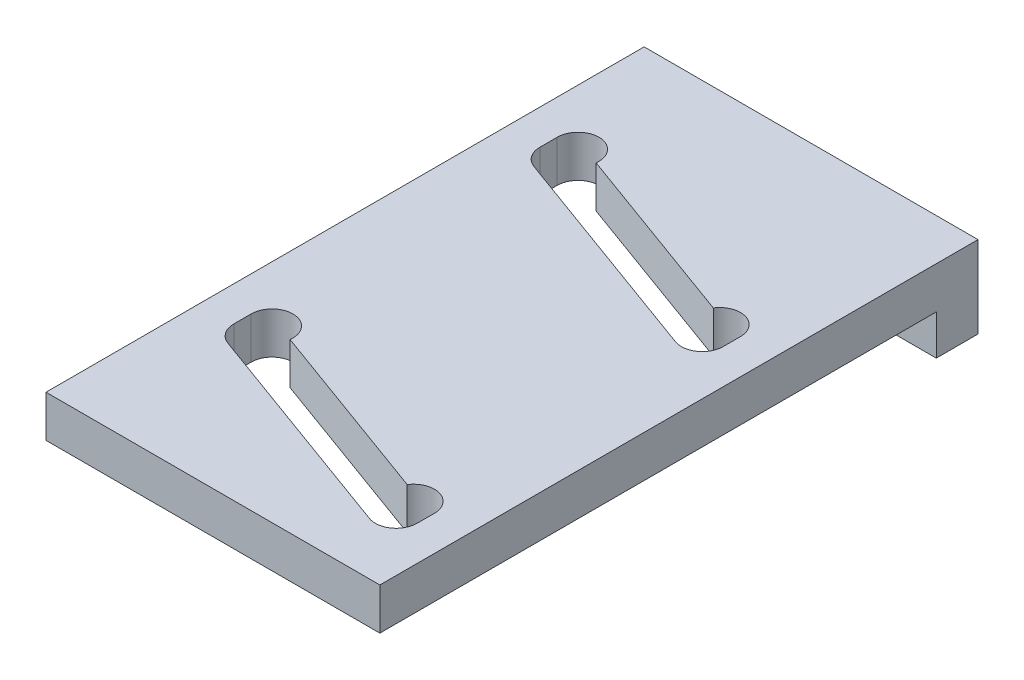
from build123d import *

# Parameters (mm, degrees)
SKETCH1_W           = 76.2
SKETCH1_H           = 127
BOSS_EXTRUDE1_DEPTH = 4.7625
CUT_EXTRUDE1_DEPTH  = 133.933575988
CUT_EXTRUDE2_DEPTH  = 133.933575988
LPATTERN1_COUNT     = 2
LPATTERN1_PITCH     = 54.06023097
SKETCH4_W           = 76.2
SKETCH4_H           = 18.669
BOSS_EXTRUDE2_DEPTH = 9.525


with BuildPart() as part:
    # Sketch1 → Boss-Extrude1 (new, symmetric)
    with BuildSketch(Plane(origin=(0, 0, 0), x_dir=(1, 0, 0), z_dir=(0, 1, 0))):
        with Locations((0, 63.5)):
            Rectangle(SKETCH1_W, SKETCH1_H)
    extrude(amount=BOSS_EXTRUDE1_DEPTH, both=True)

    # Sketch2 → Cut-Extrude1 (cut, through all)
    with BuildSketch(Plane(origin=(0, 4.7625, 0), x_dir=(1, 0, 0), z_dir=(0, 1, 0))):
        with BuildLine():
            Line((-23.771129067, 109.250286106), (27.028870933, 90.760598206))
            ThreePointArc((27.028870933, 90.760598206), (29.875286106, 84.656441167), (23.771129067, 81.810025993))
            Line((23.771129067, 81.810025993), (-27.028870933, 100.299713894))
            ThreePointArc((-27.028870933, 100.299713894), (-29.875286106, 106.403870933), (-23.771129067, 109.250286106))
        make_face()
        with BuildLine():
            Line((-23.771129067, 39.400286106), (27.028870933, 20.910598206))
            ThreePointArc((27.028870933, 20.910598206), (29.875286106, 14.806441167), (23.771129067, 11.960025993))
            Line((23.771129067, 11.960025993), (-27.028870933, 30.449713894))
            ThreePointArc((-27.028870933, 30.449713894), (-29.875286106, 36.553870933), (-23.771129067, 39.400286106))
        make_face()
    extrude(amount=-CUT_EXTRUDE1_DEPTH, mode=Mode.SUBTRACT)

    # Sketch3 → Cut-Extrude2 (cut, through all)
    with BuildSketch(Plane(origin=(0, 4.7625, 0), x_dir=(1, 0, 0), z_dir=(0, 1, 0))):
        with BuildLine():
            Line((-30.1625, 108.74375), (-30.1625, 104.775))
            Line((-30.1625, 104.775), (-20.6375, 104.775))
            Line((-20.6375, 104.775), (-20.6375, 108.74375))
            ThreePointArc((-20.6375, 108.74375), (-25.4, 113.50625), (-30.1625, 108.74375))
        make_face()
        with BuildLine():
            Line((-30.1625, 34.925), (-30.1625, 38.89375))
            ThreePointArc((-30.1625, 38.89375), (-25.4, 43.65625), (-20.6375, 38.89375))
            Line((-20.6375, 38.89375), (-20.6375, 34.925))
            Line((-20.6375, 34.925), (-30.1625, 34.925))
        make_face()
    cut_extrude2 = extrude(amount=-CUT_EXTRUDE2_DEPTH, mode=Mode.SUBTRACT)

    # LPattern1: Cut-Extrude2 ×2
    with Locations(*[Vector(0.9396926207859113, 0, 0.34202014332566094) * (i * LPATTERN1_PITCH) for i in range(1, LPATTERN1_COUNT)]):
        add(cut_extrude2, mode=Mode.SUBTRACT)

    # Sketch4 → Boss-Extrude2 (add)
    with BuildSketch(Plane(origin=(0, 0, -127), x_dir=(-1, 0, 0), z_dir=(0, 0, -1))):
        with Locations((0, -4.572)):
            Rectangle(SKETCH4_W, SKETCH4_H)
    extrude(amount=BOSS_EXTRUDE2_DEPTH)


solid = part.part
